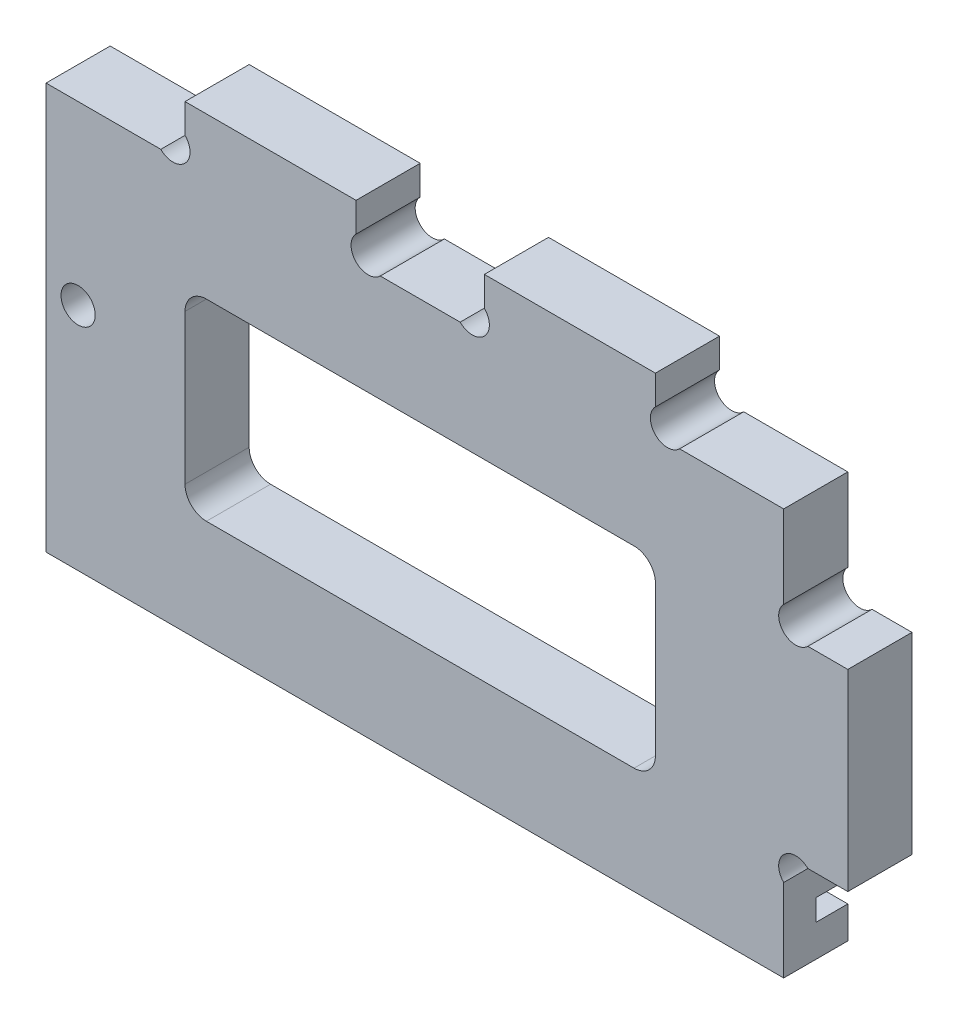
ISO-10303-21;
HEADER;
FILE_DESCRIPTION(('STEP AP214'),'2;1');
FILE_NAME('part.step','',(''),(''),'','','');
FILE_SCHEMA(('AUTOMOTIVE_DESIGN { 1 0 10303 214 1 1 1 1 }'));
ENDSEC;
DATA;
#1=APPLICATION_CONTEXT('core data for automotive mechanical design processes');
#2=APPLICATION_PROTOCOL_DEFINITION('international standard','automotive_design',2000,#1);
#3=PRODUCT_CONTEXT('',#1,'mechanical');
#4=PRODUCT('Part','Part','',(#3));
#5=PRODUCT_RELATED_PRODUCT_CATEGORY('part','',(#4));
#6=PRODUCT_DEFINITION_FORMATION('','',#4);
#7=PRODUCT_DEFINITION_CONTEXT('part definition',#1,'design');
#8=PRODUCT_DEFINITION('design','',#6,#7);
#9=PRODUCT_DEFINITION_SHAPE('','',#8);
#10=(LENGTH_UNIT() NAMED_UNIT(*) SI_UNIT(.MILLI.,.METRE.));
#11=(NAMED_UNIT(*) PLANE_ANGLE_UNIT() SI_UNIT($,.RADIAN.));
#12=(NAMED_UNIT(*) SI_UNIT($,.STERADIAN.) SOLID_ANGLE_UNIT());
#13=UNCERTAINTY_MEASURE_WITH_UNIT(LENGTH_MEASURE(1.E-05),#10,'distance_accuracy_value','');
#14=(GEOMETRIC_REPRESENTATION_CONTEXT(3) GLOBAL_UNCERTAINTY_ASSIGNED_CONTEXT((#13)) GLOBAL_UNIT_ASSIGNED_CONTEXT((#10,
#11,#12)) REPRESENTATION_CONTEXT('',''));
#15=CARTESIAN_POINT('',(0.,0.,0.));
#16=DIRECTION('',(0.,0.,1.));
#17=DIRECTION('',(1.,0.,0.));
#18=AXIS2_PLACEMENT_3D('',#15,#16,#17);
#19=CARTESIAN_POINT('',(45.1313708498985,29.1313708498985,0.));
#20=DIRECTION('',(0.,0.,1.));
#21=DIRECTION('',(1.,0.,0.));
#22=AXIS2_PLACEMENT_3D('',#19,#20,#21);
#23=PLANE('',#22);
#24=CARTESIAN_POINT('',(-22.,21.5,0.));
#25=DIRECTION('',(0.,0.,1.));
#26=DIRECTION('',(1.,0.,0.));
#27=AXIS2_PLACEMENT_3D('',#24,#25,#26);
#28=CIRCLE('',#27,1.6);
#29=CARTESIAN_POINT('',(-20.4,21.5,0.));
#30=VERTEX_POINT('',#29);
#31=EDGE_CURVE('E473',#30,#30,#28,.T.);
#32=ORIENTED_EDGE('',*,*,#31,.T.);
#33=EDGE_LOOP('',(#32));
#34=FACE_BOUND('',#33,.T.);
#35=CARTESIAN_POINT('',(-10.,25.9999999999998,0.));
#36=DIRECTION('',(0.,0.,1.));
#37=DIRECTION('',(1.,0.,0.));
#38=AXIS2_PLACEMENT_3D('',#35,#36,#37);
#39=CIRCLE('',#38,2.);
#40=CARTESIAN_POINT('',(-9.99999999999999,27.9999999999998,0.));
#41=VERTEX_POINT('',#40);
#42=CARTESIAN_POINT('',(-12.,25.9999999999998,0.));
#43=VERTEX_POINT('',#42);
#44=EDGE_CURVE('E479',#41,#43,#39,.T.);
#45=ORIENTED_EDGE('',*,*,#44,.T.);
#46=DIRECTION('',(0.,-1.,0.));
#47=VECTOR('',#46,1.);
#48=CARTESIAN_POINT('',(-12.,25.9999999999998,0.));
#49=LINE('',#48,#47);
#50=CARTESIAN_POINT('',(-12.,12.,0.));
#51=VERTEX_POINT('',#50);
#52=EDGE_CURVE('E482',#43,#51,#49,.T.);
#53=ORIENTED_EDGE('',*,*,#52,.T.);
#54=CARTESIAN_POINT('',(-10.,12.,0.));
#55=DIRECTION('',(0.,0.,1.));
#56=DIRECTION('',(1.,0.,0.));
#57=AXIS2_PLACEMENT_3D('',#54,#55,#56);
#58=CIRCLE('',#57,2.);
#59=CARTESIAN_POINT('',(-10.,10.,0.));
#60=VERTEX_POINT('',#59);
#61=EDGE_CURVE('E485',#51,#60,#58,.T.);
#62=ORIENTED_EDGE('',*,*,#61,.T.);
#63=DIRECTION('',(1.,0.,0.));
#64=VECTOR('',#63,1.);
#65=CARTESIAN_POINT('',(-10.,10.,0.));
#66=LINE('',#65,#64);
#67=CARTESIAN_POINT('',(29.9999999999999,10.,0.));
#68=VERTEX_POINT('',#67);
#69=EDGE_CURVE('E488',#60,#68,#66,.T.);
#70=ORIENTED_EDGE('',*,*,#69,.T.);
#71=CARTESIAN_POINT('',(30.,12.,0.));
#72=DIRECTION('',(0.,0.,1.));
#73=DIRECTION('',(1.,0.,0.));
#74=AXIS2_PLACEMENT_3D('',#71,#72,#73);
#75=CIRCLE('',#74,2.);
#76=CARTESIAN_POINT('',(32.,12.,0.));
#77=VERTEX_POINT('',#76);
#78=EDGE_CURVE('E491',#68,#77,#75,.T.);
#79=ORIENTED_EDGE('',*,*,#78,.T.);
#80=DIRECTION('',(0.,1.,0.));
#81=VECTOR('',#80,1.);
#82=CARTESIAN_POINT('',(32.,25.9999999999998,0.));
#83=LINE('',#82,#81);
#84=CARTESIAN_POINT('',(32.,25.9999999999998,0.));
#85=VERTEX_POINT('',#84);
#86=EDGE_CURVE('E494',#77,#85,#83,.T.);
#87=ORIENTED_EDGE('',*,*,#86,.T.);
#88=CARTESIAN_POINT('',(30.,25.9999999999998,0.));
#89=DIRECTION('',(0.,0.,1.));
#90=DIRECTION('',(-1.,0.,0.));
#91=AXIS2_PLACEMENT_3D('',#88,#89,#90);
#92=CIRCLE('',#91,2.);
#93=CARTESIAN_POINT('',(29.9999999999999,27.9999999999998,0.));
#94=VERTEX_POINT('',#93);
#95=EDGE_CURVE('E497',#85,#94,#92,.T.);
#96=ORIENTED_EDGE('',*,*,#95,.T.);
#97=DIRECTION('',(-1.,0.,0.));
#98=VECTOR('',#97,1.);
#99=CARTESIAN_POINT('',(-10.,27.9999999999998,0.));
#100=LINE('',#99,#98);
#101=EDGE_CURVE('E500',#94,#41,#100,.T.);
#102=ORIENTED_EDGE('',*,*,#101,.T.);
#103=EDGE_LOOP('',(#45,#53,#62,#70,#79,#87,#96,#102));
#104=FACE_BOUND('',#103,.T.);
#105=DIRECTION('',(0.,1.,0.));
#106=VECTOR('',#105,1.);
#107=CARTESIAN_POINT('',(44.,7.73725830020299,0.));
#108=LINE('',#107,#106);
#109=CARTESIAN_POINT('',(44.,5.,0.));
#110=VERTEX_POINT('',#109);
#111=CARTESIAN_POINT('',(44.,7.73725830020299,0.));
#112=VERTEX_POINT('',#111);
#113=EDGE_CURVE('E279',#110,#112,#108,.T.);
#114=ORIENTED_EDGE('',*,*,#113,.F.);
#115=DIRECTION('',(1.,0.,0.));
#116=VECTOR('',#115,1.);
#117=CARTESIAN_POINT('',(44.,5.,0.));
#118=LINE('',#117,#116);
#119=CARTESIAN_POINT('',(-25.,5.,0.));
#120=VERTEX_POINT('',#119);
#121=EDGE_CURVE('E271',#120,#110,#118,.T.);
#122=ORIENTED_EDGE('',*,*,#121,.F.);
#123=DIRECTION('',(0.,-1.,0.));
#124=VECTOR('',#123,1.);
#125=CARTESIAN_POINT('',(-25.,38.,0.));
#126=LINE('',#125,#124);
#127=CARTESIAN_POINT('',(-25.,38.,0.));
#128=VERTEX_POINT('',#127);
#129=EDGE_CURVE('E437',#128,#120,#126,.T.);
#130=ORIENTED_EDGE('',*,*,#129,.F.);
#131=DIRECTION('',(-1.,0.,0.));
#132=VECTOR('',#131,1.);
#133=CARTESIAN_POINT('',(-25.,38.,0.));
#134=LINE('',#133,#132);
#135=CARTESIAN_POINT('',(-14.262741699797,38.,0.));
#136=VERTEX_POINT('',#135);
#137=EDGE_CURVE('E436',#136,#128,#134,.T.);
#138=ORIENTED_EDGE('',*,*,#137,.F.);
#139=CARTESIAN_POINT('',(-13.1313708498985,39.1313708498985,0.));
#140=DIRECTION('',(0.,0.,-1.));
#141=DIRECTION('',(-1.,0.,0.));
#142=AXIS2_PLACEMENT_3D('',#139,#140,#141);
#143=CIRCLE('',#142,1.6);
#144=CARTESIAN_POINT('',(-12.,40.2627416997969,0.));
#145=VERTEX_POINT('',#144);
#146=EDGE_CURVE('E434',#145,#136,#143,.T.);
#147=ORIENTED_EDGE('',*,*,#146,.F.);
#148=DIRECTION('',(0.,-1.,0.));
#149=VECTOR('',#148,1.);
#150=CARTESIAN_POINT('',(-12.,40.2627416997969,0.));
#151=LINE('',#150,#149);
#152=CARTESIAN_POINT('',(-12.,43.,0.));
#153=VERTEX_POINT('',#152);
#154=EDGE_CURVE('E432',#153,#145,#151,.T.);
#155=ORIENTED_EDGE('',*,*,#154,.F.);
#156=DIRECTION('',(-1.,0.,0.));
#157=VECTOR('',#156,1.);
#158=CARTESIAN_POINT('',(3.99999999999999,43.,0.));
#159=LINE('',#158,#157);
#160=CARTESIAN_POINT('',(3.99999999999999,43.,0.));
#161=VERTEX_POINT('',#160);
#162=EDGE_CURVE('E430',#161,#153,#159,.T.);
#163=ORIENTED_EDGE('',*,*,#162,.F.);
#164=DIRECTION('',(0.,1.,0.));
#165=VECTOR('',#164,1.);
#166=CARTESIAN_POINT('',(3.99999999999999,40.2627416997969,0.));
#167=LINE('',#166,#165);
#168=CARTESIAN_POINT('',(3.99999999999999,40.2627416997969,0.));
#169=VERTEX_POINT('',#168);
#170=EDGE_CURVE('E428',#169,#161,#167,.T.);
#171=ORIENTED_EDGE('',*,*,#170,.F.);
#172=CARTESIAN_POINT('',(5.13137084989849,39.1313708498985,0.));
#173=DIRECTION('',(0.,0.,-1.));
#174=DIRECTION('',(1.,0.,0.));
#175=AXIS2_PLACEMENT_3D('',#172,#173,#174);
#176=CIRCLE('',#175,1.6);
#177=CARTESIAN_POINT('',(6.26274169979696,38.,0.));
#178=VERTEX_POINT('',#177);
#179=EDGE_CURVE('E426',#178,#169,#176,.T.);
#180=ORIENTED_EDGE('',*,*,#179,.F.);
#181=DIRECTION('',(-1.,0.,0.));
#182=VECTOR('',#181,1.);
#183=CARTESIAN_POINT('',(6.26274169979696,38.,0.));
#184=LINE('',#183,#182);
#185=CARTESIAN_POINT('',(13.737258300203,38.,0.));
#186=VERTEX_POINT('',#185);
#187=EDGE_CURVE('E424',#186,#178,#184,.T.);
#188=ORIENTED_EDGE('',*,*,#187,.F.);
#189=CARTESIAN_POINT('',(14.8686291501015,39.1313708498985,0.));
#190=DIRECTION('',(0.,0.,-1.));
#191=DIRECTION('',(-1.,0.,0.));
#192=AXIS2_PLACEMENT_3D('',#189,#190,#191);
#193=CIRCLE('',#192,1.6);
#194=CARTESIAN_POINT('',(16.,40.2627416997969,0.));
#195=VERTEX_POINT('',#194);
#196=EDGE_CURVE('E422',#195,#186,#193,.T.);
#197=ORIENTED_EDGE('',*,*,#196,.F.);
#198=DIRECTION('',(0.,-1.,0.));
#199=VECTOR('',#198,1.);
#200=CARTESIAN_POINT('',(16.,40.2627416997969,0.));
#201=LINE('',#200,#199);
#202=CARTESIAN_POINT('',(16.,43.,0.));
#203=VERTEX_POINT('',#202);
#204=EDGE_CURVE('E420',#203,#195,#201,.T.);
#205=ORIENTED_EDGE('',*,*,#204,.F.);
#206=DIRECTION('',(-1.,0.,0.));
#207=VECTOR('',#206,1.);
#208=CARTESIAN_POINT('',(16.,43.,0.));
#209=LINE('',#208,#207);
#210=CARTESIAN_POINT('',(32.,43.,0.));
#211=VERTEX_POINT('',#210);
#212=EDGE_CURVE('E418',#211,#203,#209,.T.);
#213=ORIENTED_EDGE('',*,*,#212,.F.);
#214=DIRECTION('',(0.,1.,0.));
#215=VECTOR('',#214,1.);
#216=CARTESIAN_POINT('',(32.,40.2627416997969,0.));
#217=LINE('',#216,#215);
#218=CARTESIAN_POINT('',(32.,40.2627416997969,0.));
#219=VERTEX_POINT('',#218);
#220=EDGE_CURVE('E411',#219,#211,#217,.T.);
#221=ORIENTED_EDGE('',*,*,#220,.F.);
#222=CARTESIAN_POINT('',(33.1313708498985,39.1313708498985,0.));
#223=DIRECTION('',(0.,0.,-1.));
#224=DIRECTION('',(1.,0.,0.));
#225=AXIS2_PLACEMENT_3D('',#222,#223,#224);
#226=CIRCLE('',#225,1.6);
#227=CARTESIAN_POINT('',(34.262741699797,38.,0.));
#228=VERTEX_POINT('',#227);
#229=EDGE_CURVE('E409',#228,#219,#226,.T.);
#230=ORIENTED_EDGE('',*,*,#229,.F.);
#231=DIRECTION('',(-1.,0.,0.));
#232=VECTOR('',#231,1.);
#233=CARTESIAN_POINT('',(34.262741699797,38.,0.));
#234=LINE('',#233,#232);
#235=CARTESIAN_POINT('',(44.,38.,0.));
#236=VERTEX_POINT('',#235);
#237=EDGE_CURVE('E401',#236,#228,#234,.T.);
#238=ORIENTED_EDGE('',*,*,#237,.F.);
#239=DIRECTION('',(0.,1.,0.));
#240=VECTOR('',#239,1.);
#241=CARTESIAN_POINT('',(44.,38.,0.));
#242=LINE('',#241,#240);
#243=CARTESIAN_POINT('',(44.,30.262741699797,0.));
#244=VERTEX_POINT('',#243);
#245=EDGE_CURVE('E407',#244,#236,#242,.T.);
#246=ORIENTED_EDGE('',*,*,#245,.F.);
#247=CARTESIAN_POINT('',(45.1313708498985,29.1313708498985,0.));
#248=DIRECTION('',(0.,0.,-1.));
#249=DIRECTION('',(1.,0.,0.));
#250=AXIS2_PLACEMENT_3D('',#247,#248,#249);
#251=CIRCLE('',#250,1.60000000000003);
#252=CARTESIAN_POINT('',(46.2627416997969,28.,0.));
#253=VERTEX_POINT('',#252);
#254=EDGE_CURVE('E413',#253,#244,#251,.T.);
#255=ORIENTED_EDGE('',*,*,#254,.F.);
#256=DIRECTION('',(-1.,0.,0.));
#257=VECTOR('',#256,1.);
#258=CARTESIAN_POINT('',(46.2627416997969,28.,0.));
#259=LINE('',#258,#257);
#260=CARTESIAN_POINT('',(49.9999999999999,28.0000000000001,0.));
#261=VERTEX_POINT('',#260);
#262=EDGE_CURVE('E290',#261,#253,#259,.T.);
#263=ORIENTED_EDGE('',*,*,#262,.F.);
#264=DIRECTION('',(0.,1.,0.));
#265=VECTOR('',#264,1.);
#266=CARTESIAN_POINT('',(49.9999999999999,28.0000000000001,0.));
#267=LINE('',#266,#265);
#268=CARTESIAN_POINT('',(49.9999999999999,9.99999999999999,0.));
#269=VERTEX_POINT('',#268);
#270=EDGE_CURVE('E288',#269,#261,#267,.T.);
#271=ORIENTED_EDGE('',*,*,#270,.F.);
#272=DIRECTION('',(1.,0.,0.));
#273=VECTOR('',#272,1.);
#274=CARTESIAN_POINT('',(49.9999999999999,9.99999999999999,0.));
#275=LINE('',#274,#273);
#276=CARTESIAN_POINT('',(46.2627416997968,10.,0.));
#277=VERTEX_POINT('',#276);
#278=EDGE_CURVE('E281',#277,#269,#275,.T.);
#279=ORIENTED_EDGE('',*,*,#278,.F.);
#280=CARTESIAN_POINT('',(45.1313708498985,8.86862915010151,0.));
#281=DIRECTION('',(0.,0.,-1.));
#282=DIRECTION('',(-1.,0.,0.));
#283=AXIS2_PLACEMENT_3D('',#280,#281,#282);
#284=CIRCLE('',#283,1.59999999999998);
#285=EDGE_CURVE('E278',#112,#277,#284,.T.);
#286=ORIENTED_EDGE('',*,*,#285,.F.);
#287=EDGE_LOOP('',(#114,#122,#130,#138,#147,#155,#163,#171,#180,#188,#197,#205,#213,#221,#230,
#238,#246,#255,#263,#271,#279,#286));
#288=FACE_BOUND('',#287,.T.);
#289=ADVANCED_FACE('F30',(#34,#104,#288),#23,.F.);
#290=CARTESIAN_POINT('',(45.1313708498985,29.1313708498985,6.));
#291=DIRECTION('',(0.,0.,1.));
#292=DIRECTION('',(1.,0.,0.));
#293=AXIS2_PLACEMENT_3D('',#290,#291,#292);
#294=PLANE('',#293);
#295=DIRECTION('',(0.,-1.,0.));
#296=VECTOR('',#295,1.);
#297=CARTESIAN_POINT('',(-12.,25.9999999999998,6.));
#298=LINE('',#297,#296);
#299=CARTESIAN_POINT('',(-12.,25.9999999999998,6.));
#300=VERTEX_POINT('',#299);
#301=CARTESIAN_POINT('',(-12.,12.,6.));
#302=VERTEX_POINT('',#301);
#303=EDGE_CURVE('E505',#300,#302,#298,.T.);
#304=ORIENTED_EDGE('',*,*,#303,.F.);
#305=CARTESIAN_POINT('',(-10.,25.9999999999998,6.));
#306=DIRECTION('',(0.,0.,1.));
#307=DIRECTION('',(1.,0.,0.));
#308=AXIS2_PLACEMENT_3D('',#305,#306,#307);
#309=CIRCLE('',#308,2.);
#310=CARTESIAN_POINT('',(-10.,27.9999999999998,6.));
#311=VERTEX_POINT('',#310);
#312=EDGE_CURVE('E503',#311,#300,#309,.T.);
#313=ORIENTED_EDGE('',*,*,#312,.F.);
#314=DIRECTION('',(-1.,0.,0.));
#315=VECTOR('',#314,1.);
#316=CARTESIAN_POINT('',(-10.,27.9999999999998,6.));
#317=LINE('',#316,#315);
#318=CARTESIAN_POINT('',(29.9999999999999,27.9999999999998,6.));
#319=VERTEX_POINT('',#318);
#320=EDGE_CURVE('E517',#319,#311,#317,.T.);
#321=ORIENTED_EDGE('',*,*,#320,.F.);
#322=CARTESIAN_POINT('',(30.,25.9999999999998,6.));
#323=DIRECTION('',(0.,0.,1.));
#324=DIRECTION('',(-1.,0.,0.));
#325=AXIS2_PLACEMENT_3D('',#322,#323,#324);
#326=CIRCLE('',#325,2.);
#327=CARTESIAN_POINT('',(32.,25.9999999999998,6.));
#328=VERTEX_POINT('',#327);
#329=EDGE_CURVE('E515',#328,#319,#326,.T.);
#330=ORIENTED_EDGE('',*,*,#329,.F.);
#331=DIRECTION('',(0.,1.,0.));
#332=VECTOR('',#331,1.);
#333=CARTESIAN_POINT('',(32.,25.9999999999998,6.));
#334=LINE('',#333,#332);
#335=CARTESIAN_POINT('',(32.,12.,6.));
#336=VERTEX_POINT('',#335);
#337=EDGE_CURVE('E513',#336,#328,#334,.T.);
#338=ORIENTED_EDGE('',*,*,#337,.F.);
#339=CARTESIAN_POINT('',(30.,12.,6.));
#340=DIRECTION('',(0.,0.,1.));
#341=DIRECTION('',(1.,0.,0.));
#342=AXIS2_PLACEMENT_3D('',#339,#340,#341);
#343=CIRCLE('',#342,2.);
#344=CARTESIAN_POINT('',(29.9999999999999,10.,6.));
#345=VERTEX_POINT('',#344);
#346=EDGE_CURVE('E511',#345,#336,#343,.T.);
#347=ORIENTED_EDGE('',*,*,#346,.F.);
#348=DIRECTION('',(1.,0.,0.));
#349=VECTOR('',#348,1.);
#350=CARTESIAN_POINT('',(-10.,10.,6.));
#351=LINE('',#350,#349);
#352=CARTESIAN_POINT('',(-10.,10.,6.));
#353=VERTEX_POINT('',#352);
#354=EDGE_CURVE('E509',#353,#345,#351,.T.);
#355=ORIENTED_EDGE('',*,*,#354,.F.);
#356=CARTESIAN_POINT('',(-10.,12.,6.));
#357=DIRECTION('',(0.,0.,1.));
#358=DIRECTION('',(1.,0.,0.));
#359=AXIS2_PLACEMENT_3D('',#356,#357,#358);
#360=CIRCLE('',#359,2.);
#361=EDGE_CURVE('E507',#302,#353,#360,.T.);
#362=ORIENTED_EDGE('',*,*,#361,.F.);
#363=EDGE_LOOP('',(#304,#313,#321,#330,#338,#347,#355,#362));
#364=FACE_BOUND('',#363,.T.);
#365=CARTESIAN_POINT('',(45.1313708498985,29.1313708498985,6.));
#366=DIRECTION('',(0.,0.,-1.));
#367=DIRECTION('',(1.,0.,0.));
#368=AXIS2_PLACEMENT_3D('',#365,#366,#367);
#369=CIRCLE('',#368,1.60000000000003);
#370=CARTESIAN_POINT('',(46.2627416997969,28.,6.));
#371=VERTEX_POINT('',#370);
#372=CARTESIAN_POINT('',(44.,30.262741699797,6.));
#373=VERTEX_POINT('',#372);
#374=EDGE_CURVE('E292',#371,#373,#369,.T.);
#375=ORIENTED_EDGE('',*,*,#374,.T.);
#376=DIRECTION('',(0.,1.,0.));
#377=VECTOR('',#376,1.);
#378=CARTESIAN_POINT('',(44.,38.,6.));
#379=LINE('',#378,#377);
#380=CARTESIAN_POINT('',(44.,38.,6.));
#381=VERTEX_POINT('',#380);
#382=EDGE_CURVE('E295',#373,#381,#379,.T.);
#383=ORIENTED_EDGE('',*,*,#382,.T.);
#384=DIRECTION('',(-1.,0.,0.));
#385=VECTOR('',#384,1.);
#386=CARTESIAN_POINT('',(34.262741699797,38.,6.));
#387=LINE('',#386,#385);
#388=CARTESIAN_POINT('',(34.262741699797,38.,6.));
#389=VERTEX_POINT('',#388);
#390=EDGE_CURVE('E297',#381,#389,#387,.T.);
#391=ORIENTED_EDGE('',*,*,#390,.T.);
#392=CARTESIAN_POINT('',(33.1313708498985,39.1313708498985,6.));
#393=DIRECTION('',(0.,0.,-1.));
#394=DIRECTION('',(1.,0.,0.));
#395=AXIS2_PLACEMENT_3D('',#392,#393,#394);
#396=CIRCLE('',#395,1.6);
#397=CARTESIAN_POINT('',(32.,40.2627416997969,6.));
#398=VERTEX_POINT('',#397);
#399=EDGE_CURVE('E299',#389,#398,#396,.T.);
#400=ORIENTED_EDGE('',*,*,#399,.T.);
#401=DIRECTION('',(0.,1.,0.));
#402=VECTOR('',#401,1.);
#403=CARTESIAN_POINT('',(32.,40.2627416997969,6.));
#404=LINE('',#403,#402);
#405=CARTESIAN_POINT('',(32.,43.,6.));
#406=VERTEX_POINT('',#405);
#407=EDGE_CURVE('E301',#398,#406,#404,.T.);
#408=ORIENTED_EDGE('',*,*,#407,.T.);
#409=DIRECTION('',(-1.,0.,0.));
#410=VECTOR('',#409,1.);
#411=CARTESIAN_POINT('',(16.,43.,6.));
#412=LINE('',#411,#410);
#413=CARTESIAN_POINT('',(16.,43.,6.));
#414=VERTEX_POINT('',#413);
#415=EDGE_CURVE('E303',#406,#414,#412,.T.);
#416=ORIENTED_EDGE('',*,*,#415,.T.);
#417=DIRECTION('',(0.,-1.,0.));
#418=VECTOR('',#417,1.);
#419=CARTESIAN_POINT('',(16.,40.2627416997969,6.));
#420=LINE('',#419,#418);
#421=CARTESIAN_POINT('',(16.,40.2627416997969,6.));
#422=VERTEX_POINT('',#421);
#423=EDGE_CURVE('E305',#414,#422,#420,.T.);
#424=ORIENTED_EDGE('',*,*,#423,.T.);
#425=CARTESIAN_POINT('',(14.8686291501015,39.1313708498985,6.));
#426=DIRECTION('',(0.,0.,-1.));
#427=DIRECTION('',(-1.,0.,0.));
#428=AXIS2_PLACEMENT_3D('',#425,#426,#427);
#429=CIRCLE('',#428,1.6);
#430=CARTESIAN_POINT('',(13.737258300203,38.,6.));
#431=VERTEX_POINT('',#430);
#432=EDGE_CURVE('E307',#422,#431,#429,.T.);
#433=ORIENTED_EDGE('',*,*,#432,.T.);
#434=DIRECTION('',(-1.,0.,0.));
#435=VECTOR('',#434,1.);
#436=CARTESIAN_POINT('',(6.26274169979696,38.,6.));
#437=LINE('',#436,#435);
#438=CARTESIAN_POINT('',(6.26274169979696,38.,6.));
#439=VERTEX_POINT('',#438);
#440=EDGE_CURVE('E309',#431,#439,#437,.T.);
#441=ORIENTED_EDGE('',*,*,#440,.T.);
#442=CARTESIAN_POINT('',(5.13137084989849,39.1313708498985,6.));
#443=DIRECTION('',(0.,0.,-1.));
#444=DIRECTION('',(1.,0.,0.));
#445=AXIS2_PLACEMENT_3D('',#442,#443,#444);
#446=CIRCLE('',#445,1.6);
#447=CARTESIAN_POINT('',(3.99999999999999,40.2627416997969,6.));
#448=VERTEX_POINT('',#447);
#449=EDGE_CURVE('E311',#439,#448,#446,.T.);
#450=ORIENTED_EDGE('',*,*,#449,.T.);
#451=DIRECTION('',(0.,1.,0.));
#452=VECTOR('',#451,1.);
#453=CARTESIAN_POINT('',(3.99999999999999,40.2627416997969,6.));
#454=LINE('',#453,#452);
#455=CARTESIAN_POINT('',(3.99999999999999,43.,6.));
#456=VERTEX_POINT('',#455);
#457=EDGE_CURVE('E313',#448,#456,#454,.T.);
#458=ORIENTED_EDGE('',*,*,#457,.T.);
#459=DIRECTION('',(-1.,0.,0.));
#460=VECTOR('',#459,1.);
#461=CARTESIAN_POINT('',(3.99999999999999,43.,6.));
#462=LINE('',#461,#460);
#463=CARTESIAN_POINT('',(-12.,43.,6.));
#464=VERTEX_POINT('',#463);
#465=EDGE_CURVE('E315',#456,#464,#462,.T.);
#466=ORIENTED_EDGE('',*,*,#465,.T.);
#467=DIRECTION('',(0.,-1.,0.));
#468=VECTOR('',#467,1.);
#469=CARTESIAN_POINT('',(-12.,40.2627416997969,6.));
#470=LINE('',#469,#468);
#471=CARTESIAN_POINT('',(-12.,40.2627416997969,6.));
#472=VERTEX_POINT('',#471);
#473=EDGE_CURVE('E317',#464,#472,#470,.T.);
#474=ORIENTED_EDGE('',*,*,#473,.T.);
#475=CARTESIAN_POINT('',(-13.1313708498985,39.1313708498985,6.));
#476=DIRECTION('',(0.,0.,-1.));
#477=DIRECTION('',(-1.,0.,0.));
#478=AXIS2_PLACEMENT_3D('',#475,#476,#477);
#479=CIRCLE('',#478,1.6);
#480=CARTESIAN_POINT('',(-14.262741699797,38.,6.));
#481=VERTEX_POINT('',#480);
#482=EDGE_CURVE('E319',#472,#481,#479,.T.);
#483=ORIENTED_EDGE('',*,*,#482,.T.);
#484=DIRECTION('',(-1.,0.,0.));
#485=VECTOR('',#484,1.);
#486=CARTESIAN_POINT('',(-25.,38.,6.));
#487=LINE('',#486,#485);
#488=CARTESIAN_POINT('',(-25.,38.,6.));
#489=VERTEX_POINT('',#488);
#490=EDGE_CURVE('E321',#481,#489,#487,.T.);
#491=ORIENTED_EDGE('',*,*,#490,.T.);
#492=DIRECTION('',(0.,-1.,0.));
#493=VECTOR('',#492,1.);
#494=CARTESIAN_POINT('',(-25.,38.,6.));
#495=LINE('',#494,#493);
#496=CARTESIAN_POINT('',(-25.,0.,6.));
#497=VERTEX_POINT('',#496);
#498=EDGE_CURVE('E323',#489,#497,#495,.T.);
#499=ORIENTED_EDGE('',*,*,#498,.T.);
#500=DIRECTION('',(1.,0.,0.));
#501=VECTOR('',#500,1.);
#502=CARTESIAN_POINT('',(43.9999999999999,0.,6.));
#503=LINE('',#502,#501);
#504=CARTESIAN_POINT('',(43.9999999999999,0.,6.));
#505=VERTEX_POINT('',#504);
#506=EDGE_CURVE('E325',#497,#505,#503,.T.);
#507=ORIENTED_EDGE('',*,*,#506,.T.);
#508=DIRECTION('',(0.,1.,0.));
#509=VECTOR('',#508,1.);
#510=CARTESIAN_POINT('',(44.,7.73725830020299,6.));
#511=LINE('',#510,#509);
#512=CARTESIAN_POINT('',(44.,7.73725830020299,6.));
#513=VERTEX_POINT('',#512);
#514=EDGE_CURVE('E327',#505,#513,#511,.T.);
#515=ORIENTED_EDGE('',*,*,#514,.T.);
#516=CARTESIAN_POINT('',(45.1313708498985,8.86862915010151,6.));
#517=DIRECTION('',(0.,0.,-1.));
#518=DIRECTION('',(-1.,0.,0.));
#519=AXIS2_PLACEMENT_3D('',#516,#517,#518);
#520=CIRCLE('',#519,1.59999999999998);
#521=CARTESIAN_POINT('',(46.2627416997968,10.,6.));
#522=VERTEX_POINT('',#521);
#523=EDGE_CURVE('E329',#513,#522,#520,.T.);
#524=ORIENTED_EDGE('',*,*,#523,.T.);
#525=DIRECTION('',(1.,0.,0.));
#526=VECTOR('',#525,1.);
#527=CARTESIAN_POINT('',(49.9999999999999,9.99999999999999,6.));
#528=LINE('',#527,#526);
#529=CARTESIAN_POINT('',(49.9999999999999,9.99999999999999,6.));
#530=VERTEX_POINT('',#529);
#531=EDGE_CURVE('E331',#522,#530,#528,.T.);
#532=ORIENTED_EDGE('',*,*,#531,.T.);
#533=DIRECTION('',(0.,1.,0.));
#534=VECTOR('',#533,1.);
#535=CARTESIAN_POINT('',(49.9999999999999,28.0000000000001,6.));
#536=LINE('',#535,#534);
#537=CARTESIAN_POINT('',(49.9999999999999,28.0000000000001,6.));
#538=VERTEX_POINT('',#537);
#539=EDGE_CURVE('E333',#530,#538,#536,.T.);
#540=ORIENTED_EDGE('',*,*,#539,.T.);
#541=DIRECTION('',(-1.,0.,0.));
#542=VECTOR('',#541,1.);
#543=CARTESIAN_POINT('',(46.2627416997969,28.,6.));
#544=LINE('',#543,#542);
#545=EDGE_CURVE('E335',#538,#371,#544,.T.);
#546=ORIENTED_EDGE('',*,*,#545,.T.);
#547=EDGE_LOOP('',(#375,#383,#391,#400,#408,#416,#424,#433,#441,#450,#458,#466,#474,#483,#491,
#499,#507,#515,#524,#532,#540,#546));
#548=FACE_BOUND('',#547,.T.);
#549=CARTESIAN_POINT('',(-22.,21.5,6.));
#550=DIRECTION('',(0.,0.,1.));
#551=DIRECTION('',(1.,0.,0.));
#552=AXIS2_PLACEMENT_3D('',#549,#550,#551);
#553=CIRCLE('',#552,1.6);
#554=CARTESIAN_POINT('',(-20.4,21.5,6.));
#555=VERTEX_POINT('',#554);
#556=EDGE_CURVE('E476',#555,#555,#553,.T.);
#557=ORIENTED_EDGE('',*,*,#556,.F.);
#558=EDGE_LOOP('',(#557));
#559=FACE_BOUND('',#558,.T.);
#560=ADVANCED_FACE('F451',(#364,#548,#559),#294,.T.);
#561=CARTESIAN_POINT('',(-25.,3.,0.));
#562=VERTEX_POINT('',#561);
#563=CARTESIAN_POINT('',(-25.,0.,0.));
#564=VERTEX_POINT('',#563);
#565=EDGE_CURVE('E270',#562,#564,#126,.T.);
#566=ORIENTED_EDGE('',*,*,#565,.F.);
#567=DIRECTION('',(-1.,0.,0.));
#568=VECTOR('',#567,1.);
#569=CARTESIAN_POINT('',(44.,3.,0.));
#570=LINE('',#569,#568);
#571=CARTESIAN_POINT('',(44.,3.,0.));
#572=VERTEX_POINT('',#571);
#573=EDGE_CURVE('E254',#572,#562,#570,.T.);
#574=ORIENTED_EDGE('',*,*,#573,.F.);
#575=CARTESIAN_POINT('',(43.9999999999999,0.,0.));
#576=VERTEX_POINT('',#575);
#577=EDGE_CURVE('E269',#576,#572,#108,.T.);
#578=ORIENTED_EDGE('',*,*,#577,.F.);
#579=DIRECTION('',(1.,0.,0.));
#580=VECTOR('',#579,1.);
#581=CARTESIAN_POINT('',(43.9999999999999,0.,0.));
#582=LINE('',#581,#580);
#583=EDGE_CURVE('E283',#564,#576,#582,.T.);
#584=ORIENTED_EDGE('',*,*,#583,.F.);
#585=EDGE_LOOP('',(#566,#574,#578,#584));
#586=FACE_BOUND('',#585,.T.);
#587=ADVANCED_FACE('F267',(#586),#23,.F.);
#588=CARTESIAN_POINT('',(45.1313708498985,29.1313708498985,6.));
#589=DIRECTION('',(0.,0.,-1.));
#590=DIRECTION('',(-1.,0.,0.));
#591=AXIS2_PLACEMENT_3D('',#588,#589,#590);
#592=CYLINDRICAL_SURFACE('',#591,1.60000000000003);
#593=ORIENTED_EDGE('',*,*,#254,.T.);
#594=DIRECTION('',(0.,0.,-1.));
#595=VECTOR('',#594,1.);
#596=CARTESIAN_POINT('',(44.,30.262741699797,6.));
#597=LINE('',#596,#595);
#598=EDGE_CURVE('E11',#373,#244,#597,.T.);
#599=ORIENTED_EDGE('',*,*,#598,.F.);
#600=ORIENTED_EDGE('',*,*,#374,.F.);
#601=DIRECTION('',(0.,0.,-1.));
#602=VECTOR('',#601,1.);
#603=CARTESIAN_POINT('',(46.2627416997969,28.,6.));
#604=LINE('',#603,#602);
#605=EDGE_CURVE('E337',#371,#253,#604,.T.);
#606=ORIENTED_EDGE('',*,*,#605,.T.);
#607=EDGE_LOOP('',(#593,#599,#600,#606));
#608=FACE_BOUND('',#607,.T.);
#609=ADVANCED_FACE('F32',(#608),#592,.F.);
#610=CARTESIAN_POINT('',(44.,38.,6.));
#611=DIRECTION('',(-1.,0.,0.));
#612=DIRECTION('',(0.,-1.,0.));
#613=AXIS2_PLACEMENT_3D('',#610,#611,#612);
#614=PLANE('',#613);
#615=ORIENTED_EDGE('',*,*,#245,.T.);
#616=DIRECTION('',(0.,0.,-1.));
#617=VECTOR('',#616,1.);
#618=CARTESIAN_POINT('',(44.,38.,6.));
#619=LINE('',#618,#617);
#620=EDGE_CURVE('E38',#381,#236,#619,.T.);
#621=ORIENTED_EDGE('',*,*,#620,.F.);
#622=ORIENTED_EDGE('',*,*,#382,.F.);
#623=ORIENTED_EDGE('',*,*,#598,.T.);
#624=EDGE_LOOP('',(#615,#621,#622,#623));
#625=FACE_BOUND('',#624,.T.);
#626=ADVANCED_FACE('F587',(#625),#614,.F.);
#627=CARTESIAN_POINT('',(34.262741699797,38.,6.));
#628=DIRECTION('',(0.,-1.,0.));
#629=DIRECTION('',(1.,0.,0.));
#630=AXIS2_PLACEMENT_3D('',#627,#628,#629);
#631=PLANE('',#630);
#632=ORIENTED_EDGE('',*,*,#237,.T.);
#633=DIRECTION('',(0.,0.,-1.));
#634=VECTOR('',#633,1.);
#635=CARTESIAN_POINT('',(34.262741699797,38.,6.));
#636=LINE('',#635,#634);
#637=EDGE_CURVE('E392',#389,#228,#636,.T.);
#638=ORIENTED_EDGE('',*,*,#637,.F.);
#639=ORIENTED_EDGE('',*,*,#390,.F.);
#640=ORIENTED_EDGE('',*,*,#620,.T.);
#641=EDGE_LOOP('',(#632,#638,#639,#640));
#642=FACE_BOUND('',#641,.T.);
#643=ADVANCED_FACE('F399',(#642),#631,.F.);
#644=CARTESIAN_POINT('',(33.1313708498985,39.1313708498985,6.));
#645=DIRECTION('',(0.,0.,-1.));
#646=DIRECTION('',(-1.,0.,0.));
#647=AXIS2_PLACEMENT_3D('',#644,#645,#646);
#648=CYLINDRICAL_SURFACE('',#647,1.6);
#649=ORIENTED_EDGE('',*,*,#229,.T.);
#650=DIRECTION('',(0.,0.,-1.));
#651=VECTOR('',#650,1.);
#652=CARTESIAN_POINT('',(32.,40.2627416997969,6.));
#653=LINE('',#652,#651);
#654=EDGE_CURVE('E389',#398,#219,#653,.T.);
#655=ORIENTED_EDGE('',*,*,#654,.F.);
#656=ORIENTED_EDGE('',*,*,#399,.F.);
#657=ORIENTED_EDGE('',*,*,#637,.T.);
#658=EDGE_LOOP('',(#649,#655,#656,#657));
#659=FACE_BOUND('',#658,.T.);
#660=ADVANCED_FACE('F594',(#659),#648,.F.);
#661=CARTESIAN_POINT('',(32.,40.2627416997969,6.));
#662=DIRECTION('',(-1.,0.,0.));
#663=DIRECTION('',(0.,-1.,0.));
#664=AXIS2_PLACEMENT_3D('',#661,#662,#663);
#665=PLANE('',#664);
#666=ORIENTED_EDGE('',*,*,#220,.T.);
#667=DIRECTION('',(0.,0.,-1.));
#668=VECTOR('',#667,1.);
#669=CARTESIAN_POINT('',(32.,43.,6.));
#670=LINE('',#669,#668);
#671=EDGE_CURVE('E386',#406,#211,#670,.T.);
#672=ORIENTED_EDGE('',*,*,#671,.F.);
#673=ORIENTED_EDGE('',*,*,#407,.F.);
#674=ORIENTED_EDGE('',*,*,#654,.T.);
#675=EDGE_LOOP('',(#666,#672,#673,#674));
#676=FACE_BOUND('',#675,.T.);
#677=ADVANCED_FACE('F599',(#676),#665,.F.);
#678=CARTESIAN_POINT('',(16.,43.,6.));
#679=DIRECTION('',(0.,-1.,0.));
#680=DIRECTION('',(1.,0.,0.));
#681=AXIS2_PLACEMENT_3D('',#678,#679,#680);
#682=PLANE('',#681);
#683=ORIENTED_EDGE('',*,*,#212,.T.);
#684=DIRECTION('',(0.,0.,-1.));
#685=VECTOR('',#684,1.);
#686=CARTESIAN_POINT('',(16.,43.,6.));
#687=LINE('',#686,#685);
#688=EDGE_CURVE('E383',#414,#203,#687,.T.);
#689=ORIENTED_EDGE('',*,*,#688,.F.);
#690=ORIENTED_EDGE('',*,*,#415,.F.);
#691=ORIENTED_EDGE('',*,*,#671,.T.);
#692=EDGE_LOOP('',(#683,#689,#690,#691));
#693=FACE_BOUND('',#692,.T.);
#694=ADVANCED_FACE('F603',(#693),#682,.F.);
#695=CARTESIAN_POINT('',(16.,40.2627416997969,6.));
#696=DIRECTION('',(1.,0.,0.));
#697=DIRECTION('',(0.,0.,-1.));
#698=AXIS2_PLACEMENT_3D('',#695,#696,#697);
#699=PLANE('',#698);
#700=ORIENTED_EDGE('',*,*,#204,.T.);
#701=DIRECTION('',(0.,0.,-1.));
#702=VECTOR('',#701,1.);
#703=CARTESIAN_POINT('',(16.,40.2627416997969,6.));
#704=LINE('',#703,#702);
#705=EDGE_CURVE('E380',#422,#195,#704,.T.);
#706=ORIENTED_EDGE('',*,*,#705,.F.);
#707=ORIENTED_EDGE('',*,*,#423,.F.);
#708=ORIENTED_EDGE('',*,*,#688,.T.);
#709=EDGE_LOOP('',(#700,#706,#707,#708));
#710=FACE_BOUND('',#709,.T.);
#711=ADVANCED_FACE('F607',(#710),#699,.F.);
#712=CARTESIAN_POINT('',(14.8686291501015,39.1313708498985,6.));
#713=DIRECTION('',(0.,0.,-1.));
#714=DIRECTION('',(-1.,0.,0.));
#715=AXIS2_PLACEMENT_3D('',#712,#713,#714);
#716=CYLINDRICAL_SURFACE('',#715,1.6);
#717=ORIENTED_EDGE('',*,*,#196,.T.);
#718=DIRECTION('',(0.,0.,-1.));
#719=VECTOR('',#718,1.);
#720=CARTESIAN_POINT('',(13.737258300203,38.,6.));
#721=LINE('',#720,#719);
#722=EDGE_CURVE('E377',#431,#186,#721,.T.);
#723=ORIENTED_EDGE('',*,*,#722,.F.);
#724=ORIENTED_EDGE('',*,*,#432,.F.);
#725=ORIENTED_EDGE('',*,*,#705,.T.);
#726=EDGE_LOOP('',(#717,#723,#724,#725));
#727=FACE_BOUND('',#726,.T.);
#728=ADVANCED_FACE('F611',(#727),#716,.F.);
#729=CARTESIAN_POINT('',(6.26274169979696,38.,6.));
#730=DIRECTION('',(0.,-1.,0.));
#731=DIRECTION('',(0.,0.,-1.));
#732=AXIS2_PLACEMENT_3D('',#729,#730,#731);
#733=PLANE('',#732);
#734=ORIENTED_EDGE('',*,*,#187,.T.);
#735=DIRECTION('',(0.,0.,-1.));
#736=VECTOR('',#735,1.);
#737=CARTESIAN_POINT('',(6.26274169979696,38.,6.));
#738=LINE('',#737,#736);
#739=EDGE_CURVE('E374',#439,#178,#738,.T.);
#740=ORIENTED_EDGE('',*,*,#739,.F.);
#741=ORIENTED_EDGE('',*,*,#440,.F.);
#742=ORIENTED_EDGE('',*,*,#722,.T.);
#743=EDGE_LOOP('',(#734,#740,#741,#742));
#744=FACE_BOUND('',#743,.T.);
#745=ADVANCED_FACE('F615',(#744),#733,.F.);
#746=CARTESIAN_POINT('',(5.13137084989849,39.1313708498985,6.));
#747=DIRECTION('',(0.,0.,-1.));
#748=DIRECTION('',(-1.,0.,0.));
#749=AXIS2_PLACEMENT_3D('',#746,#747,#748);
#750=CYLINDRICAL_SURFACE('',#749,1.6);
#751=ORIENTED_EDGE('',*,*,#179,.T.);
#752=DIRECTION('',(0.,0.,-1.));
#753=VECTOR('',#752,1.);
#754=CARTESIAN_POINT('',(3.99999999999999,40.2627416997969,6.));
#755=LINE('',#754,#753);
#756=EDGE_CURVE('E371',#448,#169,#755,.T.);
#757=ORIENTED_EDGE('',*,*,#756,.F.);
#758=ORIENTED_EDGE('',*,*,#449,.F.);
#759=ORIENTED_EDGE('',*,*,#739,.T.);
#760=EDGE_LOOP('',(#751,#757,#758,#759));
#761=FACE_BOUND('',#760,.T.);
#762=ADVANCED_FACE('F619',(#761),#750,.F.);
#763=CARTESIAN_POINT('',(3.99999999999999,40.2627416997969,6.));
#764=DIRECTION('',(-1.,0.,0.));
#765=DIRECTION('',(0.,0.,1.));
#766=AXIS2_PLACEMENT_3D('',#763,#764,#765);
#767=PLANE('',#766);
#768=ORIENTED_EDGE('',*,*,#170,.T.);
#769=DIRECTION('',(0.,0.,-1.));
#770=VECTOR('',#769,1.);
#771=CARTESIAN_POINT('',(3.99999999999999,43.,6.));
#772=LINE('',#771,#770);
#773=EDGE_CURVE('E368',#456,#161,#772,.T.);
#774=ORIENTED_EDGE('',*,*,#773,.F.);
#775=ORIENTED_EDGE('',*,*,#457,.F.);
#776=ORIENTED_EDGE('',*,*,#756,.T.);
#777=EDGE_LOOP('',(#768,#774,#775,#776));
#778=FACE_BOUND('',#777,.T.);
#779=ADVANCED_FACE('F623',(#778),#767,.F.);
#780=CARTESIAN_POINT('',(3.99999999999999,43.,6.));
#781=DIRECTION('',(0.,-1.,0.));
#782=DIRECTION('',(1.,0.,0.));
#783=AXIS2_PLACEMENT_3D('',#780,#781,#782);
#784=PLANE('',#783);
#785=ORIENTED_EDGE('',*,*,#162,.T.);
#786=DIRECTION('',(0.,0.,-1.));
#787=VECTOR('',#786,1.);
#788=CARTESIAN_POINT('',(-12.,43.,6.));
#789=LINE('',#788,#787);
#790=EDGE_CURVE('E365',#464,#153,#789,.T.);
#791=ORIENTED_EDGE('',*,*,#790,.F.);
#792=ORIENTED_EDGE('',*,*,#465,.F.);
#793=ORIENTED_EDGE('',*,*,#773,.T.);
#794=EDGE_LOOP('',(#785,#791,#792,#793));
#795=FACE_BOUND('',#794,.T.);
#796=ADVANCED_FACE('F627',(#795),#784,.F.);
#797=CARTESIAN_POINT('',(-12.,40.2627416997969,6.));
#798=DIRECTION('',(1.,0.,0.));
#799=DIRECTION('',(0.,0.,-1.));
#800=AXIS2_PLACEMENT_3D('',#797,#798,#799);
#801=PLANE('',#800);
#802=ORIENTED_EDGE('',*,*,#154,.T.);
#803=DIRECTION('',(0.,0.,-1.));
#804=VECTOR('',#803,1.);
#805=CARTESIAN_POINT('',(-12.,40.2627416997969,6.));
#806=LINE('',#805,#804);
#807=EDGE_CURVE('E362',#472,#145,#806,.T.);
#808=ORIENTED_EDGE('',*,*,#807,.F.);
#809=ORIENTED_EDGE('',*,*,#473,.F.);
#810=ORIENTED_EDGE('',*,*,#790,.T.);
#811=EDGE_LOOP('',(#802,#808,#809,#810));
#812=FACE_BOUND('',#811,.T.);
#813=ADVANCED_FACE('F631',(#812),#801,.F.);
#814=CARTESIAN_POINT('',(-13.1313708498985,39.1313708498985,6.));
#815=DIRECTION('',(0.,0.,-1.));
#816=DIRECTION('',(-1.,0.,0.));
#817=AXIS2_PLACEMENT_3D('',#814,#815,#816);
#818=CYLINDRICAL_SURFACE('',#817,1.6);
#819=ORIENTED_EDGE('',*,*,#146,.T.);
#820=DIRECTION('',(0.,0.,-1.));
#821=VECTOR('',#820,1.);
#822=CARTESIAN_POINT('',(-14.262741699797,38.,6.));
#823=LINE('',#822,#821);
#824=EDGE_CURVE('E359',#481,#136,#823,.T.);
#825=ORIENTED_EDGE('',*,*,#824,.F.);
#826=ORIENTED_EDGE('',*,*,#482,.F.);
#827=ORIENTED_EDGE('',*,*,#807,.T.);
#828=EDGE_LOOP('',(#819,#825,#826,#827));
#829=FACE_BOUND('',#828,.T.);
#830=ADVANCED_FACE('F635',(#829),#818,.F.);
#831=CARTESIAN_POINT('',(-25.,38.,6.));
#832=DIRECTION('',(0.,-1.,0.));
#833=DIRECTION('',(0.,0.,-1.));
#834=AXIS2_PLACEMENT_3D('',#831,#832,#833);
#835=PLANE('',#834);
#836=ORIENTED_EDGE('',*,*,#137,.T.);
#837=DIRECTION('',(0.,0.,-1.));
#838=VECTOR('',#837,1.);
#839=CARTESIAN_POINT('',(-25.,38.,6.));
#840=LINE('',#839,#838);
#841=EDGE_CURVE('E356',#489,#128,#840,.T.);
#842=ORIENTED_EDGE('',*,*,#841,.F.);
#843=ORIENTED_EDGE('',*,*,#490,.F.);
#844=ORIENTED_EDGE('',*,*,#824,.T.);
#845=EDGE_LOOP('',(#836,#842,#843,#844));
#846=FACE_BOUND('',#845,.T.);
#847=ADVANCED_FACE('F639',(#846),#835,.F.);
#848=CARTESIAN_POINT('',(-25.,38.,6.));
#849=DIRECTION('',(1.,0.,0.));
#850=DIRECTION('',(0.,1.,0.));
#851=AXIS2_PLACEMENT_3D('',#848,#849,#850);
#852=PLANE('',#851);
#853=ORIENTED_EDGE('',*,*,#129,.T.);
#854=DIRECTION('',(0.,0.,1.));
#855=VECTOR('',#854,1.);
#856=CARTESIAN_POINT('',(-25.,5.,6.));
#857=LINE('',#856,#855);
#858=CARTESIAN_POINT('',(-25.,5.,3.));
#859=VERTEX_POINT('',#858);
#860=EDGE_CURVE('E471',#120,#859,#857,.T.);
#861=ORIENTED_EDGE('',*,*,#860,.T.);
#862=DIRECTION('',(0.,1.,0.));
#863=VECTOR('',#862,1.);
#864=CARTESIAN_POINT('',(-25.,38.,3.));
#865=LINE('',#864,#863);
#866=CARTESIAN_POINT('',(-25.,3.,3.));
#867=VERTEX_POINT('',#866);
#868=EDGE_CURVE('E467',#867,#859,#865,.T.);
#869=ORIENTED_EDGE('',*,*,#868,.F.);
#870=DIRECTION('',(0.,0.,-1.));
#871=VECTOR('',#870,1.);
#872=CARTESIAN_POINT('',(-25.,3.,6.));
#873=LINE('',#872,#871);
#874=EDGE_CURVE('E447',#867,#562,#873,.T.);
#875=ORIENTED_EDGE('',*,*,#874,.T.);
#876=ORIENTED_EDGE('',*,*,#565,.T.);
#877=DIRECTION('',(0.,0.,-1.));
#878=VECTOR('',#877,1.);
#879=CARTESIAN_POINT('',(-25.,0.,6.));
#880=LINE('',#879,#878);
#881=EDGE_CURVE('E353',#497,#564,#880,.T.);
#882=ORIENTED_EDGE('',*,*,#881,.F.);
#883=ORIENTED_EDGE('',*,*,#498,.F.);
#884=ORIENTED_EDGE('',*,*,#841,.T.);
#885=EDGE_LOOP('',(#853,#861,#869,#875,#876,#882,#883,#884));
#886=FACE_BOUND('',#885,.T.);
#887=ADVANCED_FACE('F443',(#886),#852,.F.);
#888=CARTESIAN_POINT('',(43.9999999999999,0.,6.));
#889=DIRECTION('',(0.,1.,0.));
#890=DIRECTION('',(-1.,0.,0.));
#891=AXIS2_PLACEMENT_3D('',#888,#889,#890);
#892=PLANE('',#891);
#893=ORIENTED_EDGE('',*,*,#583,.T.);
#894=DIRECTION('',(0.,0.,-1.));
#895=VECTOR('',#894,1.);
#896=CARTESIAN_POINT('',(43.9999999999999,0.,6.));
#897=LINE('',#896,#895);
#898=EDGE_CURVE('E277',#505,#576,#897,.T.);
#899=ORIENTED_EDGE('',*,*,#898,.F.);
#900=ORIENTED_EDGE('',*,*,#506,.F.);
#901=ORIENTED_EDGE('',*,*,#881,.T.);
#902=EDGE_LOOP('',(#893,#899,#900,#901));
#903=FACE_BOUND('',#902,.T.);
#904=ADVANCED_FACE('F449',(#903),#892,.F.);
#905=CARTESIAN_POINT('',(44.,7.73725830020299,6.));
#906=DIRECTION('',(-1.,0.,0.));
#907=DIRECTION('',(0.,-1.,0.));
#908=AXIS2_PLACEMENT_3D('',#905,#906,#907);
#909=PLANE('',#908);
#910=DIRECTION('',(0.,-1.,0.));
#911=VECTOR('',#910,1.);
#912=CARTESIAN_POINT('',(44.,5.,3.));
#913=LINE('',#912,#911);
#914=CARTESIAN_POINT('',(44.,5.,3.));
#915=VERTEX_POINT('',#914);
#916=CARTESIAN_POINT('',(44.,3.,3.));
#917=VERTEX_POINT('',#916);
#918=EDGE_CURVE('E461',#915,#917,#913,.T.);
#919=ORIENTED_EDGE('',*,*,#918,.F.);
#920=DIRECTION('',(0.,0.,-1.));
#921=VECTOR('',#920,1.);
#922=CARTESIAN_POINT('',(44.,5.,3.));
#923=LINE('',#922,#921);
#924=EDGE_CURVE('E45',#915,#110,#923,.T.);
#925=ORIENTED_EDGE('',*,*,#924,.T.);
#926=ORIENTED_EDGE('',*,*,#113,.T.);
#927=DIRECTION('',(0.,0.,-1.));
#928=VECTOR('',#927,1.);
#929=CARTESIAN_POINT('',(44.,7.73725830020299,6.));
#930=LINE('',#929,#928);
#931=EDGE_CURVE('E349',#513,#112,#930,.T.);
#932=ORIENTED_EDGE('',*,*,#931,.F.);
#933=ORIENTED_EDGE('',*,*,#514,.F.);
#934=ORIENTED_EDGE('',*,*,#898,.T.);
#935=ORIENTED_EDGE('',*,*,#577,.T.);
#936=DIRECTION('',(0.,0.,-1.));
#937=VECTOR('',#936,1.);
#938=CARTESIAN_POINT('',(44.,3.,3.));
#939=LINE('',#938,#937);
#940=EDGE_CURVE('E251',#917,#572,#939,.T.);
#941=ORIENTED_EDGE('',*,*,#940,.F.);
#942=EDGE_LOOP('',(#919,#925,#926,#932,#933,#934,#935,#941));
#943=FACE_BOUND('',#942,.T.);
#944=ADVANCED_FACE('F274',(#943),#909,.F.);
#945=CARTESIAN_POINT('',(45.1313708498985,8.86862915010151,6.));
#946=DIRECTION('',(0.,0.,-1.));
#947=DIRECTION('',(-1.,0.,0.));
#948=AXIS2_PLACEMENT_3D('',#945,#946,#947);
#949=CYLINDRICAL_SURFACE('',#948,1.59999999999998);
#950=ORIENTED_EDGE('',*,*,#285,.T.);
#951=DIRECTION('',(0.,0.,-1.));
#952=VECTOR('',#951,1.);
#953=CARTESIAN_POINT('',(46.2627416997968,10.,6.));
#954=LINE('',#953,#952);
#955=EDGE_CURVE('E346',#522,#277,#954,.T.);
#956=ORIENTED_EDGE('',*,*,#955,.F.);
#957=ORIENTED_EDGE('',*,*,#523,.F.);
#958=ORIENTED_EDGE('',*,*,#931,.T.);
#959=EDGE_LOOP('',(#950,#956,#957,#958));
#960=FACE_BOUND('',#959,.T.);
#961=ADVANCED_FACE('F556',(#960),#949,.F.);
#962=CARTESIAN_POINT('',(49.9999999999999,9.99999999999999,6.));
#963=DIRECTION('',(0.,1.,0.));
#964=DIRECTION('',(-1.,0.,0.));
#965=AXIS2_PLACEMENT_3D('',#962,#963,#964);
#966=PLANE('',#965);
#967=ORIENTED_EDGE('',*,*,#278,.T.);
#968=DIRECTION('',(0.,0.,-1.));
#969=VECTOR('',#968,1.);
#970=CARTESIAN_POINT('',(49.9999999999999,9.99999999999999,6.));
#971=LINE('',#970,#969);
#972=EDGE_CURVE('E343',#530,#269,#971,.T.);
#973=ORIENTED_EDGE('',*,*,#972,.F.);
#974=ORIENTED_EDGE('',*,*,#531,.F.);
#975=ORIENTED_EDGE('',*,*,#955,.T.);
#976=EDGE_LOOP('',(#967,#973,#974,#975));
#977=FACE_BOUND('',#976,.T.);
#978=ADVANCED_FACE('F553',(#977),#966,.F.);
#979=CARTESIAN_POINT('',(49.9999999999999,28.0000000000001,6.));
#980=DIRECTION('',(-1.,0.,0.));
#981=DIRECTION('',(0.,-1.,0.));
#982=AXIS2_PLACEMENT_3D('',#979,#980,#981);
#983=PLANE('',#982);
#984=ORIENTED_EDGE('',*,*,#270,.T.);
#985=DIRECTION('',(0.,0.,-1.));
#986=VECTOR('',#985,1.);
#987=CARTESIAN_POINT('',(49.9999999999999,28.0000000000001,6.));
#988=LINE('',#987,#986);
#989=EDGE_CURVE('E340',#538,#261,#988,.T.);
#990=ORIENTED_EDGE('',*,*,#989,.F.);
#991=ORIENTED_EDGE('',*,*,#539,.F.);
#992=ORIENTED_EDGE('',*,*,#972,.T.);
#993=EDGE_LOOP('',(#984,#990,#991,#992));
#994=FACE_BOUND('',#993,.T.);
#995=ADVANCED_FACE('F549',(#994),#983,.F.);
#996=CARTESIAN_POINT('',(46.2627416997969,28.,6.));
#997=DIRECTION('',(0.,-1.,0.));
#998=DIRECTION('',(1.,0.,0.));
#999=AXIS2_PLACEMENT_3D('',#996,#997,#998);
#1000=PLANE('',#999);
#1001=ORIENTED_EDGE('',*,*,#262,.T.);
#1002=ORIENTED_EDGE('',*,*,#605,.F.);
#1003=ORIENTED_EDGE('',*,*,#545,.F.);
#1004=ORIENTED_EDGE('',*,*,#989,.T.);
#1005=EDGE_LOOP('',(#1001,#1002,#1003,#1004));
#1006=FACE_BOUND('',#1005,.T.);
#1007=ADVANCED_FACE('F544',(#1006),#1000,.F.);
#1008=CARTESIAN_POINT('',(-10.,25.9999999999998,6.));
#1009=DIRECTION('',(0.,0.,-1.));
#1010=DIRECTION('',(-1.,0.,0.));
#1011=AXIS2_PLACEMENT_3D('',#1008,#1009,#1010);
#1012=CYLINDRICAL_SURFACE('',#1011,2.);
#1013=ORIENTED_EDGE('',*,*,#44,.F.);
#1014=DIRECTION('',(0.,0.,-1.));
#1015=VECTOR('',#1014,1.);
#1016=CARTESIAN_POINT('',(-10.,27.9999999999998,6.));
#1017=LINE('',#1016,#1015);
#1018=EDGE_CURVE('E519',#311,#41,#1017,.T.);
#1019=ORIENTED_EDGE('',*,*,#1018,.F.);
#1020=ORIENTED_EDGE('',*,*,#312,.T.);
#1021=DIRECTION('',(0.,0.,-1.));
#1022=VECTOR('',#1021,1.);
#1023=CARTESIAN_POINT('',(-12.,25.9999999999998,6.));
#1024=LINE('',#1023,#1022);
#1025=EDGE_CURVE('E533',#300,#43,#1024,.T.);
#1026=ORIENTED_EDGE('',*,*,#1025,.T.);
#1027=EDGE_LOOP('',(#1013,#1019,#1020,#1026));
#1028=FACE_BOUND('',#1027,.T.);
#1029=ADVANCED_FACE('F656',(#1028),#1012,.F.);
#1030=CARTESIAN_POINT('',(-12.,25.9999999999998,6.));
#1031=DIRECTION('',(1.,0.,0.));
#1032=DIRECTION('',(0.,0.,-1.));
#1033=AXIS2_PLACEMENT_3D('',#1030,#1031,#1032);
#1034=PLANE('',#1033);
#1035=ORIENTED_EDGE('',*,*,#52,.F.);
#1036=ORIENTED_EDGE('',*,*,#1025,.F.);
#1037=ORIENTED_EDGE('',*,*,#303,.T.);
#1038=DIRECTION('',(0.,0.,-1.));
#1039=VECTOR('',#1038,1.);
#1040=CARTESIAN_POINT('',(-12.,12.,6.));
#1041=LINE('',#1040,#1039);
#1042=EDGE_CURVE('E531',#302,#51,#1041,.T.);
#1043=ORIENTED_EDGE('',*,*,#1042,.T.);
#1044=EDGE_LOOP('',(#1035,#1036,#1037,#1043));
#1045=FACE_BOUND('',#1044,.T.);
#1046=ADVANCED_FACE('F660',(#1045),#1034,.T.);
#1047=CARTESIAN_POINT('',(-10.,12.,6.));
#1048=DIRECTION('',(0.,0.,-1.));
#1049=DIRECTION('',(-1.,0.,0.));
#1050=AXIS2_PLACEMENT_3D('',#1047,#1048,#1049);
#1051=CYLINDRICAL_SURFACE('',#1050,2.);
#1052=ORIENTED_EDGE('',*,*,#61,.F.);
#1053=ORIENTED_EDGE('',*,*,#1042,.F.);
#1054=ORIENTED_EDGE('',*,*,#361,.T.);
#1055=DIRECTION('',(0.,0.,-1.));
#1056=VECTOR('',#1055,1.);
#1057=CARTESIAN_POINT('',(-10.,10.,6.));
#1058=LINE('',#1057,#1056);
#1059=EDGE_CURVE('E529',#353,#60,#1058,.T.);
#1060=ORIENTED_EDGE('',*,*,#1059,.T.);
#1061=EDGE_LOOP('',(#1052,#1053,#1054,#1060));
#1062=FACE_BOUND('',#1061,.T.);
#1063=ADVANCED_FACE('F665',(#1062),#1051,.F.);
#1064=CARTESIAN_POINT('',(-10.,10.,6.));
#1065=DIRECTION('',(0.,1.,0.));
#1066=DIRECTION('',(0.,0.,1.));
#1067=AXIS2_PLACEMENT_3D('',#1064,#1065,#1066);
#1068=PLANE('',#1067);
#1069=ORIENTED_EDGE('',*,*,#69,.F.);
#1070=ORIENTED_EDGE('',*,*,#1059,.F.);
#1071=ORIENTED_EDGE('',*,*,#354,.T.);
#1072=DIRECTION('',(0.,0.,-1.));
#1073=VECTOR('',#1072,1.);
#1074=CARTESIAN_POINT('',(29.9999999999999,10.,6.));
#1075=LINE('',#1074,#1073);
#1076=EDGE_CURVE('E527',#345,#68,#1075,.T.);
#1077=ORIENTED_EDGE('',*,*,#1076,.T.);
#1078=EDGE_LOOP('',(#1069,#1070,#1071,#1077));
#1079=FACE_BOUND('',#1078,.T.);
#1080=ADVANCED_FACE('F671',(#1079),#1068,.T.);
#1081=CARTESIAN_POINT('',(30.,12.,6.));
#1082=DIRECTION('',(0.,0.,-1.));
#1083=DIRECTION('',(-1.,0.,0.));
#1084=AXIS2_PLACEMENT_3D('',#1081,#1082,#1083);
#1085=CYLINDRICAL_SURFACE('',#1084,2.);
#1086=ORIENTED_EDGE('',*,*,#78,.F.);
#1087=ORIENTED_EDGE('',*,*,#1076,.F.);
#1088=ORIENTED_EDGE('',*,*,#346,.T.);
#1089=DIRECTION('',(0.,0.,-1.));
#1090=VECTOR('',#1089,1.);
#1091=CARTESIAN_POINT('',(32.,12.,6.));
#1092=LINE('',#1091,#1090);
#1093=EDGE_CURVE('E525',#336,#77,#1092,.T.);
#1094=ORIENTED_EDGE('',*,*,#1093,.T.);
#1095=EDGE_LOOP('',(#1086,#1087,#1088,#1094));
#1096=FACE_BOUND('',#1095,.T.);
#1097=ADVANCED_FACE('F675',(#1096),#1085,.F.);
#1098=CARTESIAN_POINT('',(32.,25.9999999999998,6.));
#1099=DIRECTION('',(-1.,0.,0.));
#1100=DIRECTION('',(0.,0.,1.));
#1101=AXIS2_PLACEMENT_3D('',#1098,#1099,#1100);
#1102=PLANE('',#1101);
#1103=ORIENTED_EDGE('',*,*,#86,.F.);
#1104=ORIENTED_EDGE('',*,*,#1093,.F.);
#1105=ORIENTED_EDGE('',*,*,#337,.T.);
#1106=DIRECTION('',(0.,0.,-1.));
#1107=VECTOR('',#1106,1.);
#1108=CARTESIAN_POINT('',(32.,25.9999999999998,6.));
#1109=LINE('',#1108,#1107);
#1110=EDGE_CURVE('E523',#328,#85,#1109,.T.);
#1111=ORIENTED_EDGE('',*,*,#1110,.T.);
#1112=EDGE_LOOP('',(#1103,#1104,#1105,#1111));
#1113=FACE_BOUND('',#1112,.T.);
#1114=ADVANCED_FACE('F679',(#1113),#1102,.T.);
#1115=CARTESIAN_POINT('',(30.,25.9999999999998,6.));
#1116=DIRECTION('',(0.,0.,-1.));
#1117=DIRECTION('',(-1.,0.,0.));
#1118=AXIS2_PLACEMENT_3D('',#1115,#1116,#1117);
#1119=CYLINDRICAL_SURFACE('',#1118,2.);
#1120=ORIENTED_EDGE('',*,*,#95,.F.);
#1121=ORIENTED_EDGE('',*,*,#1110,.F.);
#1122=ORIENTED_EDGE('',*,*,#329,.T.);
#1123=DIRECTION('',(0.,0.,-1.));
#1124=VECTOR('',#1123,1.);
#1125=CARTESIAN_POINT('',(29.9999999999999,27.9999999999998,6.));
#1126=LINE('',#1125,#1124);
#1127=EDGE_CURVE('E53',#319,#94,#1126,.T.);
#1128=ORIENTED_EDGE('',*,*,#1127,.T.);
#1129=EDGE_LOOP('',(#1120,#1121,#1122,#1128));
#1130=FACE_BOUND('',#1129,.T.);
#1131=ADVANCED_FACE('F683',(#1130),#1119,.F.);
#1132=CARTESIAN_POINT('',(-10.,27.9999999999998,6.));
#1133=DIRECTION('',(0.,-1.,0.));
#1134=DIRECTION('',(0.,0.,-1.));
#1135=AXIS2_PLACEMENT_3D('',#1132,#1133,#1134);
#1136=PLANE('',#1135);
#1137=ORIENTED_EDGE('',*,*,#101,.F.);
#1138=ORIENTED_EDGE('',*,*,#1127,.F.);
#1139=ORIENTED_EDGE('',*,*,#320,.T.);
#1140=ORIENTED_EDGE('',*,*,#1018,.T.);
#1141=EDGE_LOOP('',(#1137,#1138,#1139,#1140));
#1142=FACE_BOUND('',#1141,.T.);
#1143=ADVANCED_FACE('F569',(#1142),#1136,.T.);
#1144=CARTESIAN_POINT('',(-22.,21.5,6.));
#1145=DIRECTION('',(0.,0.,-1.));
#1146=DIRECTION('',(-1.,0.,0.));
#1147=AXIS2_PLACEMENT_3D('',#1144,#1145,#1146);
#1148=CYLINDRICAL_SURFACE('',#1147,1.6);
#1149=ORIENTED_EDGE('',*,*,#556,.T.);
#1150=EDGE_LOOP('',(#1149));
#1151=FACE_BOUND('',#1150,.T.);
#1152=ORIENTED_EDGE('',*,*,#31,.F.);
#1153=EDGE_LOOP('',(#1152));
#1154=FACE_BOUND('',#1153,.T.);
#1155=ADVANCED_FACE('F562',(#1151,#1154),#1148,.F.);
#1156=CARTESIAN_POINT('',(44.,5.,3.));
#1157=DIRECTION('',(0.,1.,0.));
#1158=DIRECTION('',(0.,0.,1.));
#1159=AXIS2_PLACEMENT_3D('',#1156,#1157,#1158);
#1160=PLANE('',#1159);
#1161=ORIENTED_EDGE('',*,*,#121,.T.);
#1162=ORIENTED_EDGE('',*,*,#924,.F.);
#1163=DIRECTION('',(1.,0.,0.));
#1164=VECTOR('',#1163,1.);
#1165=CARTESIAN_POINT('',(44.,5.,3.));
#1166=LINE('',#1165,#1164);
#1167=EDGE_CURVE('E262',#859,#915,#1166,.T.);
#1168=ORIENTED_EDGE('',*,*,#1167,.F.);
#1169=ORIENTED_EDGE('',*,*,#860,.F.);
#1170=EDGE_LOOP('',(#1161,#1162,#1168,#1169));
#1171=FACE_BOUND('',#1170,.T.);
#1172=ADVANCED_FACE('F560',(#1171),#1160,.F.);
#1173=CARTESIAN_POINT('',(44.,3.,3.));
#1174=DIRECTION('',(0.,-1.,0.));
#1175=DIRECTION('',(0.,0.,-1.));
#1176=AXIS2_PLACEMENT_3D('',#1173,#1174,#1175);
#1177=PLANE('',#1176);
#1178=DIRECTION('',(-1.,0.,0.));
#1179=VECTOR('',#1178,1.);
#1180=CARTESIAN_POINT('',(44.,3.,3.));
#1181=LINE('',#1180,#1179);
#1182=EDGE_CURVE('E257',#917,#867,#1181,.T.);
#1183=ORIENTED_EDGE('',*,*,#1182,.F.);
#1184=ORIENTED_EDGE('',*,*,#940,.T.);
#1185=ORIENTED_EDGE('',*,*,#573,.T.);
#1186=ORIENTED_EDGE('',*,*,#874,.F.);
#1187=EDGE_LOOP('',(#1183,#1184,#1185,#1186));
#1188=FACE_BOUND('',#1187,.T.);
#1189=ADVANCED_FACE('F253',(#1188),#1177,.F.);
#1190=CARTESIAN_POINT('',(44.,3.,3.));
#1191=DIRECTION('',(0.,0.,-1.));
#1192=DIRECTION('',(-1.,0.,0.));
#1193=AXIS2_PLACEMENT_3D('',#1190,#1191,#1192);
#1194=PLANE('',#1193);
#1195=ORIENTED_EDGE('',*,*,#868,.T.);
#1196=ORIENTED_EDGE('',*,*,#1167,.T.);
#1197=ORIENTED_EDGE('',*,*,#918,.T.);
#1198=ORIENTED_EDGE('',*,*,#1182,.T.);
#1199=EDGE_LOOP('',(#1195,#1196,#1197,#1198));
#1200=FACE_BOUND('',#1199,.T.);
#1201=ADVANCED_FACE('F559',(#1200),#1194,.T.);
#1202=CLOSED_SHELL('',(#289,#560,#587,#609,#626,#643,#660,#677,#694,#711,#728,#745,#762,#779,
#796,#813,#830,#847,#887,#904,#944,#961,#978,#995,#1007,#1029,#1046,#1063,#1080,#1097,#1114,
#1131,#1143,#1155,#1172,#1189,#1201));
#1203=MANIFOLD_SOLID_BREP('B2',#1202);
#1204=ADVANCED_BREP_SHAPE_REPRESENTATION('',(#18,#1203),#14);
#1205=SHAPE_DEFINITION_REPRESENTATION(#9,#1204);
ENDSEC;
END-ISO-10303-21;
